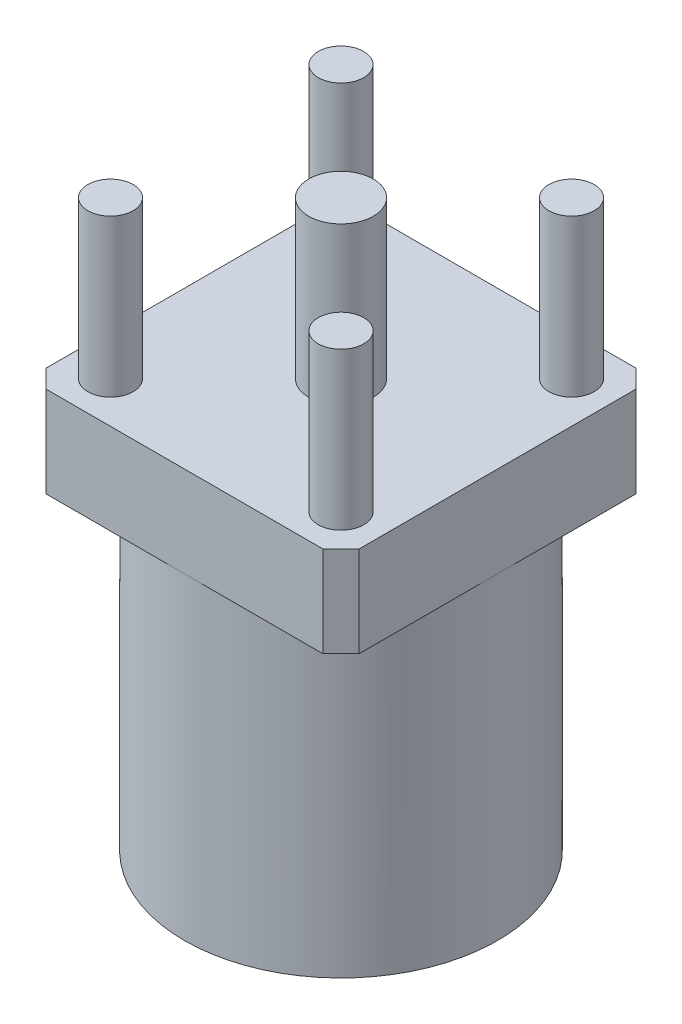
ISO-10303-21;
HEADER;
FILE_DESCRIPTION(('STEP AP214'),'2;1');
FILE_NAME('part.step','',(''),(''),'','','');
FILE_SCHEMA(('AUTOMOTIVE_DESIGN { 1 0 10303 214 1 1 1 1 }'));
ENDSEC;
DATA;
#1=APPLICATION_CONTEXT('core data for automotive mechanical design processes');
#2=APPLICATION_PROTOCOL_DEFINITION('international standard','automotive_design',2000,#1);
#3=PRODUCT_CONTEXT('',#1,'mechanical');
#4=PRODUCT('Part','Part','',(#3));
#5=PRODUCT_RELATED_PRODUCT_CATEGORY('part','',(#4));
#6=PRODUCT_DEFINITION_FORMATION('','',#4);
#7=PRODUCT_DEFINITION_CONTEXT('part definition',#1,'design');
#8=PRODUCT_DEFINITION('design','',#6,#7);
#9=PRODUCT_DEFINITION_SHAPE('','',#8);
#10=(LENGTH_UNIT() NAMED_UNIT(*) SI_UNIT(.MILLI.,.METRE.));
#11=(NAMED_UNIT(*) PLANE_ANGLE_UNIT() SI_UNIT($,.RADIAN.));
#12=(NAMED_UNIT(*) SI_UNIT($,.STERADIAN.) SOLID_ANGLE_UNIT());
#13=UNCERTAINTY_MEASURE_WITH_UNIT(LENGTH_MEASURE(1.E-05),#10,'distance_accuracy_value','');
#14=(GEOMETRIC_REPRESENTATION_CONTEXT(3) GLOBAL_UNCERTAINTY_ASSIGNED_CONTEXT((#13)) GLOBAL_UNIT_ASSIGNED_CONTEXT((#10,
#11,#12)) REPRESENTATION_CONTEXT('',''));
#15=CARTESIAN_POINT('',(0.,0.,0.));
#16=DIRECTION('',(0.,0.,1.));
#17=DIRECTION('',(1.,0.,0.));
#18=AXIS2_PLACEMENT_3D('',#15,#16,#17);
#19=CARTESIAN_POINT('',(0.,-3.5,0.));
#20=DIRECTION('',(0.,1.,0.));
#21=DIRECTION('',(0.,0.,1.));
#22=AXIS2_PLACEMENT_3D('',#19,#20,#21);
#23=CYLINDRICAL_SURFACE('',#22,0.35);
#24=CARTESIAN_POINT('',(0.,0.,0.));
#25=DIRECTION('',(0.,1.,0.));
#26=DIRECTION('',(0.,0.,1.));
#27=AXIS2_PLACEMENT_3D('',#24,#25,#26);
#28=CIRCLE('',#27,0.35);
#29=CARTESIAN_POINT('',(0.,0.,0.35));
#30=VERTEX_POINT('',#29);
#31=EDGE_CURVE('E12',#30,#30,#28,.F.);
#32=ORIENTED_EDGE('',*,*,#31,.T.);
#33=EDGE_LOOP('',(#32));
#34=FACE_BOUND('',#33,.T.);
#35=CARTESIAN_POINT('',(0.,-2.484,0.));
#36=DIRECTION('',(0.,-1.,0.));
#37=DIRECTION('',(0.,0.,-1.));
#38=AXIS2_PLACEMENT_3D('',#35,#36,#37);
#39=CIRCLE('',#38,0.35);
#40=CARTESIAN_POINT('',(0.,-2.484,-0.35));
#41=VERTEX_POINT('',#40);
#42=EDGE_CURVE('E253',#41,#41,#39,.T.);
#43=ORIENTED_EDGE('',*,*,#42,.F.);
#44=EDGE_LOOP('',(#43));
#45=FACE_BOUND('',#44,.T.);
#46=ADVANCED_FACE('F42',(#34,#45),#23,.T.);
#47=CARTESIAN_POINT('',(0.,1.,0.));
#48=DIRECTION('',(0.,1.,0.));
#49=DIRECTION('',(0.,0.,1.));
#50=AXIS2_PLACEMENT_3D('',#47,#48,#49);
#51=PLANE('',#50);
#52=CARTESIAN_POINT('',(1.27,1.,1.27));
#53=DIRECTION('',(0.,1.,0.));
#54=DIRECTION('',(0.,0.,1.));
#55=AXIS2_PLACEMENT_3D('',#52,#53,#54);
#56=CIRCLE('',#55,0.25);
#57=CARTESIAN_POINT('',(1.27,1.,1.52));
#58=VERTEX_POINT('',#57);
#59=EDGE_CURVE('E244',#58,#58,#56,.T.);
#60=ORIENTED_EDGE('',*,*,#59,.F.);
#61=EDGE_LOOP('',(#60));
#62=FACE_BOUND('',#61,.T.);
#63=CARTESIAN_POINT('',(-1.27,1.,1.27));
#64=DIRECTION('',(0.,1.,0.));
#65=DIRECTION('',(0.,0.,1.));
#66=AXIS2_PLACEMENT_3D('',#63,#64,#65);
#67=CIRCLE('',#66,0.25);
#68=CARTESIAN_POINT('',(-1.27,1.,1.52));
#69=VERTEX_POINT('',#68);
#70=EDGE_CURVE('E232',#69,#69,#67,.T.);
#71=ORIENTED_EDGE('',*,*,#70,.F.);
#72=EDGE_LOOP('',(#71));
#73=FACE_BOUND('',#72,.T.);
#74=DIRECTION('',(1.,0.,0.));
#75=VECTOR('',#74,1.);
#76=CARTESIAN_POINT('',(-1.525,1.,1.725));
#77=LINE('',#76,#75);
#78=CARTESIAN_POINT('',(-1.525,1.,1.725));
#79=VERTEX_POINT('',#78);
#80=CARTESIAN_POINT('',(1.525,1.,1.725));
#81=VERTEX_POINT('',#80);
#82=EDGE_CURVE('E156',#79,#81,#77,.T.);
#83=ORIENTED_EDGE('',*,*,#82,.T.);
#84=DIRECTION('',(0.707106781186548,0.,-0.707106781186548));
#85=VECTOR('',#84,1.);
#86=CARTESIAN_POINT('',(1.525,1.,1.725));
#87=LINE('',#86,#85);
#88=CARTESIAN_POINT('',(1.725,1.,1.525));
#89=VERTEX_POINT('',#88);
#90=EDGE_CURVE('E159',#81,#89,#87,.T.);
#91=ORIENTED_EDGE('',*,*,#90,.T.);
#92=DIRECTION('',(0.,0.,-1.));
#93=VECTOR('',#92,1.);
#94=CARTESIAN_POINT('',(1.725,1.,1.525));
#95=LINE('',#94,#93);
#96=CARTESIAN_POINT('',(1.725,1.,-1.525));
#97=VERTEX_POINT('',#96);
#98=EDGE_CURVE('E162',#89,#97,#95,.T.);
#99=ORIENTED_EDGE('',*,*,#98,.T.);
#100=DIRECTION('',(-0.707106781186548,0.,-0.707106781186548));
#101=VECTOR('',#100,1.);
#102=CARTESIAN_POINT('',(1.525,1.,-1.725));
#103=LINE('',#102,#101);
#104=CARTESIAN_POINT('',(1.525,1.,-1.725));
#105=VERTEX_POINT('',#104);
#106=EDGE_CURVE('E164',#97,#105,#103,.T.);
#107=ORIENTED_EDGE('',*,*,#106,.T.);
#108=DIRECTION('',(-1.,0.,0.));
#109=VECTOR('',#108,1.);
#110=CARTESIAN_POINT('',(-1.525,1.,-1.725));
#111=LINE('',#110,#109);
#112=CARTESIAN_POINT('',(-1.525,1.,-1.725));
#113=VERTEX_POINT('',#112);
#114=EDGE_CURVE('E166',#105,#113,#111,.T.);
#115=ORIENTED_EDGE('',*,*,#114,.T.);
#116=DIRECTION('',(-0.707106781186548,0.,0.707106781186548));
#117=VECTOR('',#116,1.);
#118=CARTESIAN_POINT('',(-1.725,1.,-1.525));
#119=LINE('',#118,#117);
#120=CARTESIAN_POINT('',(-1.725,1.,-1.525));
#121=VERTEX_POINT('',#120);
#122=EDGE_CURVE('E168',#113,#121,#119,.T.);
#123=ORIENTED_EDGE('',*,*,#122,.T.);
#124=DIRECTION('',(0.,0.,1.));
#125=VECTOR('',#124,1.);
#126=CARTESIAN_POINT('',(-1.725,1.,1.525));
#127=LINE('',#126,#125);
#128=CARTESIAN_POINT('',(-1.725,1.,1.525));
#129=VERTEX_POINT('',#128);
#130=EDGE_CURVE('E170',#121,#129,#127,.T.);
#131=ORIENTED_EDGE('',*,*,#130,.T.);
#132=DIRECTION('',(0.707106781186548,0.,0.707106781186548));
#133=VECTOR('',#132,1.);
#134=CARTESIAN_POINT('',(-1.725,1.,1.525));
#135=LINE('',#134,#133);
#136=EDGE_CURVE('E172',#129,#79,#135,.T.);
#137=ORIENTED_EDGE('',*,*,#136,.T.);
#138=EDGE_LOOP('',(#83,#91,#99,#107,#115,#123,#131,#137));
#139=FACE_BOUND('',#138,.T.);
#140=CARTESIAN_POINT('',(-1.27,1.,-1.27));
#141=DIRECTION('',(0.,1.,0.));
#142=DIRECTION('',(0.,0.,1.));
#143=AXIS2_PLACEMENT_3D('',#140,#141,#142);
#144=CIRCLE('',#143,0.25);
#145=CARTESIAN_POINT('',(-1.27,1.,-1.02));
#146=VERTEX_POINT('',#145);
#147=EDGE_CURVE('E225',#146,#146,#144,.T.);
#148=ORIENTED_EDGE('',*,*,#147,.F.);
#149=EDGE_LOOP('',(#148));
#150=FACE_BOUND('',#149,.T.);
#151=CARTESIAN_POINT('',(1.27,1.,-1.27));
#152=DIRECTION('',(0.,1.,0.));
#153=DIRECTION('',(0.,0.,1.));
#154=AXIS2_PLACEMENT_3D('',#151,#152,#153);
#155=CIRCLE('',#154,0.25);
#156=CARTESIAN_POINT('',(1.27,1.,-1.02));
#157=VERTEX_POINT('',#156);
#158=EDGE_CURVE('E238',#157,#157,#155,.T.);
#159=ORIENTED_EDGE('',*,*,#158,.F.);
#160=EDGE_LOOP('',(#159));
#161=FACE_BOUND('',#160,.T.);
#162=CARTESIAN_POINT('',(0.,1.,0.));
#163=DIRECTION('',(0.,1.,0.));
#164=DIRECTION('',(0.,0.,1.));
#165=AXIS2_PLACEMENT_3D('',#162,#163,#164);
#166=CIRCLE('',#165,0.3556);
#167=CARTESIAN_POINT('',(0.,1.,0.3556));
#168=VERTEX_POINT('',#167);
#169=EDGE_CURVE('E250',#168,#168,#166,.T.);
#170=ORIENTED_EDGE('',*,*,#169,.F.);
#171=EDGE_LOOP('',(#170));
#172=FACE_BOUND('',#171,.T.);
#173=ADVANCED_FACE('F262',(#62,#73,#139,#150,#161,#172),#51,.T.);
#174=CARTESIAN_POINT('',(0.,0.,0.));
#175=DIRECTION('',(0.,1.,0.));
#176=DIRECTION('',(0.,0.,1.));
#177=AXIS2_PLACEMENT_3D('',#174,#175,#176);
#178=PLANE('',#177);
#179=CARTESIAN_POINT('',(0.,0.,0.));
#180=DIRECTION('',(0.,-1.,0.));
#181=DIRECTION('',(0.,0.,-1.));
#182=AXIS2_PLACEMENT_3D('',#179,#180,#181);
#183=CIRCLE('',#182,1.37499999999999);
#184=CARTESIAN_POINT('',(0.,0.,-1.37499999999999));
#185=VERTEX_POINT('',#184);
#186=EDGE_CURVE('E145',#185,#185,#183,.T.);
#187=ORIENTED_EDGE('',*,*,#186,.T.);
#188=EDGE_LOOP('',(#187));
#189=FACE_BOUND('',#188,.T.);
#190=ORIENTED_EDGE('',*,*,#31,.F.);
#191=EDGE_LOOP('',(#190));
#192=FACE_BOUND('',#191,.T.);
#193=ADVANCED_FACE('F268',(#189,#192),#178,.F.);
#194=CARTESIAN_POINT('',(0.,0.,0.));
#195=DIRECTION('',(0.,-1.,0.));
#196=DIRECTION('',(0.,0.,-1.));
#197=AXIS2_PLACEMENT_3D('',#194,#195,#196);
#198=CIRCLE('',#197,1.725);
#199=CARTESIAN_POINT('',(0.,0.,-1.725));
#200=VERTEX_POINT('',#199);
#201=CARTESIAN_POINT('',(1.725,0.,0.));
#202=VERTEX_POINT('',#201);
#203=EDGE_CURVE('E139',#200,#202,#198,.T.);
#204=ORIENTED_EDGE('',*,*,#203,.F.);
#205=DIRECTION('',(-1.,0.,0.));
#206=VECTOR('',#205,1.);
#207=CARTESIAN_POINT('',(-1.525,0.,-1.725));
#208=LINE('',#207,#206);
#209=CARTESIAN_POINT('',(1.525,0.,-1.725));
#210=VERTEX_POINT('',#209);
#211=EDGE_CURVE('E122',#210,#200,#208,.T.);
#212=ORIENTED_EDGE('',*,*,#211,.F.);
#213=DIRECTION('',(-0.707106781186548,0.,-0.707106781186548));
#214=VECTOR('',#213,1.);
#215=CARTESIAN_POINT('',(1.525,0.,-1.725));
#216=LINE('',#215,#214);
#217=CARTESIAN_POINT('',(1.725,0.,-1.525));
#218=VERTEX_POINT('',#217);
#219=EDGE_CURVE('E137',#218,#210,#216,.T.);
#220=ORIENTED_EDGE('',*,*,#219,.F.);
#221=DIRECTION('',(0.,0.,-1.));
#222=VECTOR('',#221,1.);
#223=CARTESIAN_POINT('',(1.725,0.,1.525));
#224=LINE('',#223,#222);
#225=EDGE_CURVE('E141',#202,#218,#224,.T.);
#226=ORIENTED_EDGE('',*,*,#225,.F.);
#227=EDGE_LOOP('',(#204,#212,#220,#226));
#228=FACE_BOUND('',#227,.T.);
#229=ADVANCED_FACE('F140',(#228),#178,.F.);
#230=CARTESIAN_POINT('',(0.,0.,1.725));
#231=VERTEX_POINT('',#230);
#232=EDGE_CURVE('E50',#202,#231,#198,.T.);
#233=ORIENTED_EDGE('',*,*,#232,.F.);
#234=CARTESIAN_POINT('',(1.725,0.,1.525));
#235=VERTEX_POINT('',#234);
#236=EDGE_CURVE('E181',#235,#202,#224,.T.);
#237=ORIENTED_EDGE('',*,*,#236,.F.);
#238=DIRECTION('',(0.707106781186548,0.,-0.707106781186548));
#239=VECTOR('',#238,1.);
#240=CARTESIAN_POINT('',(1.525,0.,1.725));
#241=LINE('',#240,#239);
#242=CARTESIAN_POINT('',(1.525,0.,1.725));
#243=VERTEX_POINT('',#242);
#244=EDGE_CURVE('E178',#243,#235,#241,.T.);
#245=ORIENTED_EDGE('',*,*,#244,.F.);
#246=DIRECTION('',(1.,0.,0.));
#247=VECTOR('',#246,1.);
#248=CARTESIAN_POINT('',(-1.525,0.,1.725));
#249=LINE('',#248,#247);
#250=EDGE_CURVE('E179',#231,#243,#249,.T.);
#251=ORIENTED_EDGE('',*,*,#250,.F.);
#252=EDGE_LOOP('',(#233,#237,#245,#251));
#253=FACE_BOUND('',#252,.T.);
#254=ADVANCED_FACE('F212',(#253),#178,.F.);
#255=CARTESIAN_POINT('',(-1.725,0.,0.));
#256=VERTEX_POINT('',#255);
#257=EDGE_CURVE('E149',#231,#256,#198,.T.);
#258=ORIENTED_EDGE('',*,*,#257,.F.);
#259=CARTESIAN_POINT('',(-1.525,0.,1.725));
#260=VERTEX_POINT('',#259);
#261=EDGE_CURVE('E175',#260,#231,#249,.T.);
#262=ORIENTED_EDGE('',*,*,#261,.F.);
#263=DIRECTION('',(0.707106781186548,0.,0.707106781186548));
#264=VECTOR('',#263,1.);
#265=CARTESIAN_POINT('',(-1.725,0.,1.525));
#266=LINE('',#265,#264);
#267=CARTESIAN_POINT('',(-1.725,0.,1.525));
#268=VERTEX_POINT('',#267);
#269=EDGE_CURVE('E160',#268,#260,#266,.T.);
#270=ORIENTED_EDGE('',*,*,#269,.F.);
#271=DIRECTION('',(0.,0.,1.));
#272=VECTOR('',#271,1.);
#273=CARTESIAN_POINT('',(-1.725,0.,1.525));
#274=LINE('',#273,#272);
#275=EDGE_CURVE('E185',#256,#268,#274,.T.);
#276=ORIENTED_EDGE('',*,*,#275,.F.);
#277=EDGE_LOOP('',(#258,#262,#270,#276));
#278=FACE_BOUND('',#277,.T.);
#279=ADVANCED_FACE('F315',(#278),#178,.F.);
#280=EDGE_CURVE('E64',#256,#200,#198,.T.);
#281=ORIENTED_EDGE('',*,*,#280,.F.);
#282=CARTESIAN_POINT('',(-1.725,0.,-1.525));
#283=VERTEX_POINT('',#282);
#284=EDGE_CURVE('E186',#283,#256,#274,.T.);
#285=ORIENTED_EDGE('',*,*,#284,.F.);
#286=DIRECTION('',(-0.707106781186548,0.,0.707106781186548));
#287=VECTOR('',#286,1.);
#288=CARTESIAN_POINT('',(-1.725,0.,-1.525));
#289=LINE('',#288,#287);
#290=CARTESIAN_POINT('',(-1.525,0.,-1.725));
#291=VERTEX_POINT('',#290);
#292=EDGE_CURVE('E133',#291,#283,#289,.T.);
#293=ORIENTED_EDGE('',*,*,#292,.F.);
#294=EDGE_CURVE('E125',#200,#291,#208,.T.);
#295=ORIENTED_EDGE('',*,*,#294,.F.);
#296=EDGE_LOOP('',(#281,#285,#293,#295));
#297=FACE_BOUND('',#296,.T.);
#298=ADVANCED_FACE('F136',(#297),#178,.F.);
#299=CARTESIAN_POINT('',(-1.525,1.,1.725));
#300=DIRECTION('',(0.,0.,-1.));
#301=DIRECTION('',(-1.,0.,0.));
#302=AXIS2_PLACEMENT_3D('',#299,#300,#301);
#303=PLANE('',#302);
#304=ORIENTED_EDGE('',*,*,#261,.T.);
#305=ORIENTED_EDGE('',*,*,#250,.T.);
#306=DIRECTION('',(0.,-1.,0.));
#307=VECTOR('',#306,1.);
#308=CARTESIAN_POINT('',(1.525,1.,1.725));
#309=LINE('',#308,#307);
#310=EDGE_CURVE('E150',#81,#243,#309,.T.);
#311=ORIENTED_EDGE('',*,*,#310,.F.);
#312=ORIENTED_EDGE('',*,*,#82,.F.);
#313=DIRECTION('',(0.,-1.,0.));
#314=VECTOR('',#313,1.);
#315=CARTESIAN_POINT('',(-1.525,1.,1.725));
#316=LINE('',#315,#314);
#317=EDGE_CURVE('E174',#79,#260,#316,.T.);
#318=ORIENTED_EDGE('',*,*,#317,.T.);
#319=EDGE_LOOP('',(#304,#305,#311,#312,#318));
#320=FACE_BOUND('',#319,.T.);
#321=ADVANCED_FACE('F44',(#320),#303,.F.);
#322=CARTESIAN_POINT('',(1.525,1.,1.725));
#323=DIRECTION('',(-0.707106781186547,0.,-0.707106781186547));
#324=DIRECTION('',(-0.707106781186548,0.,0.707106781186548));
#325=AXIS2_PLACEMENT_3D('',#322,#323,#324);
#326=PLANE('',#325);
#327=ORIENTED_EDGE('',*,*,#244,.T.);
#328=DIRECTION('',(0.,-1.,0.));
#329=VECTOR('',#328,1.);
#330=CARTESIAN_POINT('',(1.725,1.,1.525));
#331=LINE('',#330,#329);
#332=EDGE_CURVE('E152',#89,#235,#331,.T.);
#333=ORIENTED_EDGE('',*,*,#332,.F.);
#334=ORIENTED_EDGE('',*,*,#90,.F.);
#335=ORIENTED_EDGE('',*,*,#310,.T.);
#336=EDGE_LOOP('',(#327,#333,#334,#335));
#337=FACE_BOUND('',#336,.T.);
#338=ADVANCED_FACE('F214',(#337),#326,.F.);
#339=CARTESIAN_POINT('',(1.725,1.,1.525));
#340=DIRECTION('',(-1.,0.,0.));
#341=DIRECTION('',(0.,0.,1.));
#342=AXIS2_PLACEMENT_3D('',#339,#340,#341);
#343=PLANE('',#342);
#344=ORIENTED_EDGE('',*,*,#236,.T.);
#345=ORIENTED_EDGE('',*,*,#225,.T.);
#346=DIRECTION('',(0.,-1.,0.));
#347=VECTOR('',#346,1.);
#348=CARTESIAN_POINT('',(1.725,1.,-1.525));
#349=LINE('',#348,#347);
#350=EDGE_CURVE('E201',#97,#218,#349,.T.);
#351=ORIENTED_EDGE('',*,*,#350,.F.);
#352=ORIENTED_EDGE('',*,*,#98,.F.);
#353=ORIENTED_EDGE('',*,*,#332,.T.);
#354=EDGE_LOOP('',(#344,#345,#351,#352,#353));
#355=FACE_BOUND('',#354,.T.);
#356=ADVANCED_FACE('F208',(#355),#343,.F.);
#357=CARTESIAN_POINT('',(1.525,1.,-1.725));
#358=DIRECTION('',(-0.707106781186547,0.,0.707106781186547));
#359=DIRECTION('',(0.707106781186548,0.,0.707106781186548));
#360=AXIS2_PLACEMENT_3D('',#357,#358,#359);
#361=PLANE('',#360);
#362=ORIENTED_EDGE('',*,*,#219,.T.);
#363=DIRECTION('',(0.,-1.,0.));
#364=VECTOR('',#363,1.);
#365=CARTESIAN_POINT('',(1.525,1.,-1.725));
#366=LINE('',#365,#364);
#367=EDGE_CURVE('E129',#105,#210,#366,.T.);
#368=ORIENTED_EDGE('',*,*,#367,.F.);
#369=ORIENTED_EDGE('',*,*,#106,.F.);
#370=ORIENTED_EDGE('',*,*,#350,.T.);
#371=EDGE_LOOP('',(#362,#368,#369,#370));
#372=FACE_BOUND('',#371,.T.);
#373=ADVANCED_FACE('F303',(#372),#361,.F.);
#374=CARTESIAN_POINT('',(-1.525,1.,-1.725));
#375=DIRECTION('',(0.,0.,1.));
#376=DIRECTION('',(1.,0.,0.));
#377=AXIS2_PLACEMENT_3D('',#374,#375,#376);
#378=PLANE('',#377);
#379=ORIENTED_EDGE('',*,*,#211,.T.);
#380=ORIENTED_EDGE('',*,*,#294,.T.);
#381=DIRECTION('',(0.,-1.,0.));
#382=VECTOR('',#381,1.);
#383=CARTESIAN_POINT('',(-1.525,1.,-1.725));
#384=LINE('',#383,#382);
#385=EDGE_CURVE('E198',#113,#291,#384,.T.);
#386=ORIENTED_EDGE('',*,*,#385,.F.);
#387=ORIENTED_EDGE('',*,*,#114,.F.);
#388=ORIENTED_EDGE('',*,*,#367,.T.);
#389=EDGE_LOOP('',(#379,#380,#386,#387,#388));
#390=FACE_BOUND('',#389,.T.);
#391=ADVANCED_FACE('F123',(#390),#378,.F.);
#392=CARTESIAN_POINT('',(-1.725,1.,-1.525));
#393=DIRECTION('',(0.707106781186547,0.,0.707106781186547));
#394=DIRECTION('',(0.707106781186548,0.,-0.707106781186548));
#395=AXIS2_PLACEMENT_3D('',#392,#393,#394);
#396=PLANE('',#395);
#397=ORIENTED_EDGE('',*,*,#292,.T.);
#398=DIRECTION('',(0.,-1.,0.));
#399=VECTOR('',#398,1.);
#400=CARTESIAN_POINT('',(-1.725,1.,-1.525));
#401=LINE('',#400,#399);
#402=EDGE_CURVE('E195',#121,#283,#401,.T.);
#403=ORIENTED_EDGE('',*,*,#402,.F.);
#404=ORIENTED_EDGE('',*,*,#122,.F.);
#405=ORIENTED_EDGE('',*,*,#385,.T.);
#406=EDGE_LOOP('',(#397,#403,#404,#405));
#407=FACE_BOUND('',#406,.T.);
#408=ADVANCED_FACE('F296',(#407),#396,.F.);
#409=CARTESIAN_POINT('',(-1.725,1.,1.525));
#410=DIRECTION('',(1.,0.,0.));
#411=DIRECTION('',(0.,0.,-1.));
#412=AXIS2_PLACEMENT_3D('',#409,#410,#411);
#413=PLANE('',#412);
#414=ORIENTED_EDGE('',*,*,#284,.T.);
#415=ORIENTED_EDGE('',*,*,#275,.T.);
#416=DIRECTION('',(0.,-1.,0.));
#417=VECTOR('',#416,1.);
#418=CARTESIAN_POINT('',(-1.725,1.,1.525));
#419=LINE('',#418,#417);
#420=EDGE_CURVE('E192',#129,#268,#419,.T.);
#421=ORIENTED_EDGE('',*,*,#420,.F.);
#422=ORIENTED_EDGE('',*,*,#130,.F.);
#423=ORIENTED_EDGE('',*,*,#402,.T.);
#424=EDGE_LOOP('',(#414,#415,#421,#422,#423));
#425=FACE_BOUND('',#424,.T.);
#426=ADVANCED_FACE('F292',(#425),#413,.F.);
#427=CARTESIAN_POINT('',(-1.725,1.,1.525));
#428=DIRECTION('',(0.707106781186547,0.,-0.707106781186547));
#429=DIRECTION('',(-0.707106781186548,0.,-0.707106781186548));
#430=AXIS2_PLACEMENT_3D('',#427,#428,#429);
#431=PLANE('',#430);
#432=ORIENTED_EDGE('',*,*,#269,.T.);
#433=ORIENTED_EDGE('',*,*,#317,.F.);
#434=ORIENTED_EDGE('',*,*,#136,.F.);
#435=ORIENTED_EDGE('',*,*,#420,.T.);
#436=EDGE_LOOP('',(#432,#433,#434,#435));
#437=FACE_BOUND('',#436,.T.);
#438=ADVANCED_FACE('F284',(#437),#431,.F.);
#439=CARTESIAN_POINT('',(0.,-3.5,0.));
#440=DIRECTION('',(0.,1.,0.));
#441=DIRECTION('',(0.,0.,1.));
#442=AXIS2_PLACEMENT_3D('',#439,#440,#441);
#443=CYLINDRICAL_SURFACE('',#442,1.37499999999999);
#444=CARTESIAN_POINT('',(0.,-3.5,0.));
#445=DIRECTION('',(0.,-1.,0.));
#446=DIRECTION('',(0.,0.,-1.));
#447=AXIS2_PLACEMENT_3D('',#444,#445,#446);
#448=CIRCLE('',#447,1.37499999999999);
#449=CARTESIAN_POINT('',(0.,-3.5,-1.37499999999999));
#450=VERTEX_POINT('',#449);
#451=EDGE_CURVE('E144',#450,#450,#448,.T.);
#452=ORIENTED_EDGE('',*,*,#451,.T.);
#453=EDGE_LOOP('',(#452));
#454=FACE_BOUND('',#453,.T.);
#455=ORIENTED_EDGE('',*,*,#186,.F.);
#456=EDGE_LOOP('',(#455));
#457=FACE_BOUND('',#456,.T.);
#458=ADVANCED_FACE('F281',(#454,#457),#443,.F.);
#459=CARTESIAN_POINT('',(0.,-3.5,0.));
#460=DIRECTION('',(0.,1.,0.));
#461=DIRECTION('',(0.,0.,1.));
#462=AXIS2_PLACEMENT_3D('',#459,#460,#461);
#463=CYLINDRICAL_SURFACE('',#462,1.725);
#464=CARTESIAN_POINT('',(0.,-3.5,0.));
#465=DIRECTION('',(0.,-1.,0.));
#466=DIRECTION('',(0.,0.,-1.));
#467=AXIS2_PLACEMENT_3D('',#464,#465,#466);
#468=CIRCLE('',#467,1.725);
#469=CARTESIAN_POINT('',(0.,-3.5,-1.725));
#470=VERTEX_POINT('',#469);
#471=EDGE_CURVE('E218',#470,#470,#468,.T.);
#472=ORIENTED_EDGE('',*,*,#471,.F.);
#473=EDGE_LOOP('',(#472));
#474=FACE_BOUND('',#473,.T.);
#475=ORIENTED_EDGE('',*,*,#203,.T.);
#476=ORIENTED_EDGE('',*,*,#232,.T.);
#477=ORIENTED_EDGE('',*,*,#257,.T.);
#478=ORIENTED_EDGE('',*,*,#280,.T.);
#479=EDGE_LOOP('',(#475,#476,#477,#478));
#480=FACE_BOUND('',#479,.T.);
#481=ADVANCED_FACE('F148',(#474,#480),#463,.T.);
#482=CARTESIAN_POINT('',(0.,-3.5,0.));
#483=DIRECTION('',(0.,-1.,0.));
#484=DIRECTION('',(0.,0.,-1.));
#485=AXIS2_PLACEMENT_3D('',#482,#483,#484);
#486=PLANE('',#485);
#487=ORIENTED_EDGE('',*,*,#451,.F.);
#488=EDGE_LOOP('',(#487));
#489=FACE_BOUND('',#488,.T.);
#490=ORIENTED_EDGE('',*,*,#471,.T.);
#491=EDGE_LOOP('',(#490));
#492=FACE_BOUND('',#491,.T.);
#493=ADVANCED_FACE('F275',(#489,#492),#486,.T.);
#494=CARTESIAN_POINT('',(-1.27,2.7272,-1.27));
#495=DIRECTION('',(0.,-1.,0.));
#496=DIRECTION('',(0.,0.,-1.));
#497=AXIS2_PLACEMENT_3D('',#494,#495,#496);
#498=CYLINDRICAL_SURFACE('',#497,0.25);
#499=CARTESIAN_POINT('',(-1.27,2.7272,-1.27));
#500=DIRECTION('',(0.,1.,0.));
#501=DIRECTION('',(0.,0.,1.));
#502=AXIS2_PLACEMENT_3D('',#499,#500,#501);
#503=CIRCLE('',#502,0.25);
#504=CARTESIAN_POINT('',(-1.27,2.7272,-1.02));
#505=VERTEX_POINT('',#504);
#506=EDGE_CURVE('E228',#505,#505,#503,.T.);
#507=ORIENTED_EDGE('',*,*,#506,.F.);
#508=EDGE_LOOP('',(#507));
#509=FACE_BOUND('',#508,.T.);
#510=ORIENTED_EDGE('',*,*,#147,.T.);
#511=EDGE_LOOP('',(#510));
#512=FACE_BOUND('',#511,.T.);
#513=ADVANCED_FACE('F273',(#509,#512),#498,.T.);
#514=CARTESIAN_POINT('',(-1.27,2.7272,-1.27));
#515=DIRECTION('',(0.,1.,0.));
#516=DIRECTION('',(0.,0.,1.));
#517=AXIS2_PLACEMENT_3D('',#514,#515,#516);
#518=PLANE('',#517);
#519=ORIENTED_EDGE('',*,*,#506,.T.);
#520=EDGE_LOOP('',(#519));
#521=FACE_BOUND('',#520,.T.);
#522=ADVANCED_FACE('F374',(#521),#518,.T.);
#523=CARTESIAN_POINT('',(-1.27,2.7272,1.27));
#524=DIRECTION('',(0.,-1.,0.));
#525=DIRECTION('',(0.,0.,-1.));
#526=AXIS2_PLACEMENT_3D('',#523,#524,#525);
#527=CYLINDRICAL_SURFACE('',#526,0.25);
#528=CARTESIAN_POINT('',(-1.27,2.7272,1.27));
#529=DIRECTION('',(0.,1.,0.));
#530=DIRECTION('',(0.,0.,1.));
#531=AXIS2_PLACEMENT_3D('',#528,#529,#530);
#532=CIRCLE('',#531,0.25);
#533=CARTESIAN_POINT('',(-1.27,2.7272,1.52));
#534=VERTEX_POINT('',#533);
#535=EDGE_CURVE('E229',#534,#534,#532,.T.);
#536=ORIENTED_EDGE('',*,*,#535,.F.);
#537=EDGE_LOOP('',(#536));
#538=FACE_BOUND('',#537,.T.);
#539=ORIENTED_EDGE('',*,*,#70,.T.);
#540=EDGE_LOOP('',(#539));
#541=FACE_BOUND('',#540,.T.);
#542=ADVANCED_FACE('F371',(#538,#541),#527,.T.);
#543=CARTESIAN_POINT('',(-1.27,2.7272,1.27));
#544=DIRECTION('',(0.,1.,0.));
#545=DIRECTION('',(0.,0.,1.));
#546=AXIS2_PLACEMENT_3D('',#543,#544,#545);
#547=PLANE('',#546);
#548=ORIENTED_EDGE('',*,*,#535,.T.);
#549=EDGE_LOOP('',(#548));
#550=FACE_BOUND('',#549,.T.);
#551=ADVANCED_FACE('F367',(#550),#547,.T.);
#552=CARTESIAN_POINT('',(1.27,2.7272,-1.27));
#553=DIRECTION('',(0.,-1.,0.));
#554=DIRECTION('',(0.,0.,-1.));
#555=AXIS2_PLACEMENT_3D('',#552,#553,#554);
#556=CYLINDRICAL_SURFACE('',#555,0.25);
#557=CARTESIAN_POINT('',(1.27,2.7272,-1.27));
#558=DIRECTION('',(0.,1.,0.));
#559=DIRECTION('',(0.,0.,1.));
#560=AXIS2_PLACEMENT_3D('',#557,#558,#559);
#561=CIRCLE('',#560,0.25);
#562=CARTESIAN_POINT('',(1.27,2.7272,-1.02));
#563=VERTEX_POINT('',#562);
#564=EDGE_CURVE('E235',#563,#563,#561,.T.);
#565=ORIENTED_EDGE('',*,*,#564,.F.);
#566=EDGE_LOOP('',(#565));
#567=FACE_BOUND('',#566,.T.);
#568=ORIENTED_EDGE('',*,*,#158,.T.);
#569=EDGE_LOOP('',(#568));
#570=FACE_BOUND('',#569,.T.);
#571=ADVANCED_FACE('F363',(#567,#570),#556,.T.);
#572=CARTESIAN_POINT('',(1.27,2.7272,-1.27));
#573=DIRECTION('',(0.,1.,0.));
#574=DIRECTION('',(0.,0.,1.));
#575=AXIS2_PLACEMENT_3D('',#572,#573,#574);
#576=PLANE('',#575);
#577=ORIENTED_EDGE('',*,*,#564,.T.);
#578=EDGE_LOOP('',(#577));
#579=FACE_BOUND('',#578,.T.);
#580=ADVANCED_FACE('F359',(#579),#576,.T.);
#581=CARTESIAN_POINT('',(1.27,2.7272,1.27));
#582=DIRECTION('',(0.,-1.,0.));
#583=DIRECTION('',(0.,0.,-1.));
#584=AXIS2_PLACEMENT_3D('',#581,#582,#583);
#585=CYLINDRICAL_SURFACE('',#584,0.25);
#586=CARTESIAN_POINT('',(1.27,2.7272,1.27));
#587=DIRECTION('',(0.,1.,0.));
#588=DIRECTION('',(0.,0.,1.));
#589=AXIS2_PLACEMENT_3D('',#586,#587,#588);
#590=CIRCLE('',#589,0.25);
#591=CARTESIAN_POINT('',(1.27,2.7272,1.52));
#592=VERTEX_POINT('',#591);
#593=EDGE_CURVE('E241',#592,#592,#590,.T.);
#594=ORIENTED_EDGE('',*,*,#593,.F.);
#595=EDGE_LOOP('',(#594));
#596=FACE_BOUND('',#595,.T.);
#597=ORIENTED_EDGE('',*,*,#59,.T.);
#598=EDGE_LOOP('',(#597));
#599=FACE_BOUND('',#598,.T.);
#600=ADVANCED_FACE('F351',(#596,#599),#585,.T.);
#601=CARTESIAN_POINT('',(1.27,2.7272,1.27));
#602=DIRECTION('',(0.,1.,0.));
#603=DIRECTION('',(0.,0.,1.));
#604=AXIS2_PLACEMENT_3D('',#601,#602,#603);
#605=PLANE('',#604);
#606=ORIENTED_EDGE('',*,*,#593,.T.);
#607=EDGE_LOOP('',(#606));
#608=FACE_BOUND('',#607,.T.);
#609=ADVANCED_FACE('F342',(#608),#605,.T.);
#610=CARTESIAN_POINT('',(0.,2.7272,0.));
#611=DIRECTION('',(0.,-1.,0.));
#612=DIRECTION('',(0.,0.,-1.));
#613=AXIS2_PLACEMENT_3D('',#610,#611,#612);
#614=CYLINDRICAL_SURFACE('',#613,0.3556);
#615=CARTESIAN_POINT('',(0.,2.7272,0.));
#616=DIRECTION('',(0.,1.,0.));
#617=DIRECTION('',(0.,0.,1.));
#618=AXIS2_PLACEMENT_3D('',#615,#616,#617);
#619=CIRCLE('',#618,0.3556);
#620=CARTESIAN_POINT('',(0.,2.7272,0.3556));
#621=VERTEX_POINT('',#620);
#622=EDGE_CURVE('E247',#621,#621,#619,.T.);
#623=ORIENTED_EDGE('',*,*,#622,.F.);
#624=EDGE_LOOP('',(#623));
#625=FACE_BOUND('',#624,.T.);
#626=ORIENTED_EDGE('',*,*,#169,.T.);
#627=EDGE_LOOP('',(#626));
#628=FACE_BOUND('',#627,.T.);
#629=ADVANCED_FACE('F339',(#625,#628),#614,.T.);
#630=CARTESIAN_POINT('',(0.,2.7272,0.));
#631=DIRECTION('',(0.,1.,0.));
#632=DIRECTION('',(0.,0.,1.));
#633=AXIS2_PLACEMENT_3D('',#630,#631,#632);
#634=PLANE('',#633);
#635=ORIENTED_EDGE('',*,*,#622,.T.);
#636=EDGE_LOOP('',(#635));
#637=FACE_BOUND('',#636,.T.);
#638=ADVANCED_FACE('F341',(#637),#634,.T.);
#639=CARTESIAN_POINT('',(0.,-2.484,0.));
#640=DIRECTION('',(0.,-1.,0.));
#641=DIRECTION('',(0.,0.,-1.));
#642=AXIS2_PLACEMENT_3D('',#639,#640,#641);
#643=PLANE('',#642);
#644=ORIENTED_EDGE('',*,*,#42,.T.);
#645=EDGE_LOOP('',(#644));
#646=FACE_BOUND('',#645,.T.);
#647=ADVANCED_FACE('F259',(#646),#643,.T.);
#648=CLOSED_SHELL('',(#46,#173,#193,#229,#254,#279,#298,#321,#338,#356,#373,#391,#408,#426,#438,
#458,#481,#493,#513,#522,#542,#551,#571,#580,#600,#609,#629,#638,#647));
#649=MANIFOLD_SOLID_BREP('B2',#648);
#650=ADVANCED_BREP_SHAPE_REPRESENTATION('',(#18,#649),#14);
#651=SHAPE_DEFINITION_REPRESENTATION(#9,#650);
ENDSEC;
END-ISO-10303-21;
